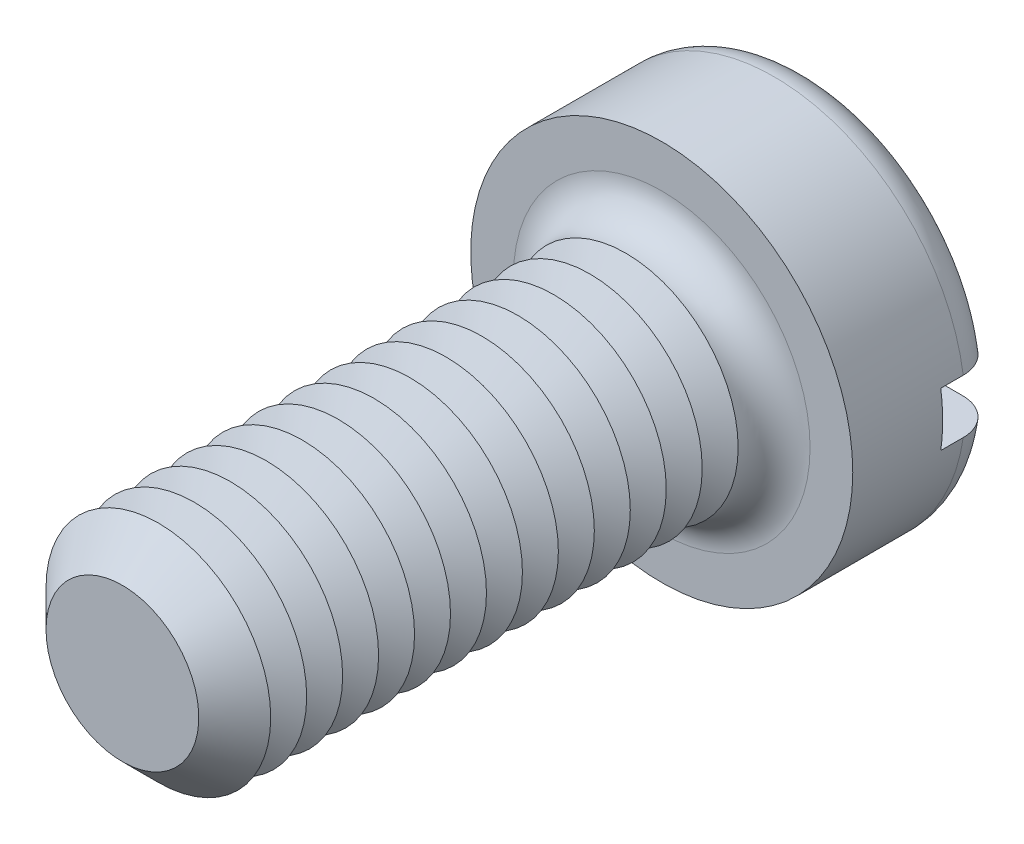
ISO-10303-21;
HEADER;
FILE_DESCRIPTION(('STEP AP214'),'2;1');
FILE_NAME('part.step','',(''),(''),'','','');
FILE_SCHEMA(('AUTOMOTIVE_DESIGN { 1 0 10303 214 1 1 1 1 }'));
ENDSEC;
DATA;
#1=APPLICATION_CONTEXT('core data for automotive mechanical design processes');
#2=APPLICATION_PROTOCOL_DEFINITION('international standard','automotive_design',2000,#1);
#3=PRODUCT_CONTEXT('',#1,'mechanical');
#4=PRODUCT('Part','Part','',(#3));
#5=PRODUCT_RELATED_PRODUCT_CATEGORY('part','',(#4));
#6=PRODUCT_DEFINITION_FORMATION('','',#4);
#7=PRODUCT_DEFINITION_CONTEXT('part definition',#1,'design');
#8=PRODUCT_DEFINITION('design','',#6,#7);
#9=PRODUCT_DEFINITION_SHAPE('','',#8);
#10=(LENGTH_UNIT() NAMED_UNIT(*) SI_UNIT(.MILLI.,.METRE.));
#11=(NAMED_UNIT(*) PLANE_ANGLE_UNIT() SI_UNIT($,.RADIAN.));
#12=(NAMED_UNIT(*) SI_UNIT($,.STERADIAN.) SOLID_ANGLE_UNIT());
#13=UNCERTAINTY_MEASURE_WITH_UNIT(LENGTH_MEASURE(1.E-05),#10,'distance_accuracy_value','');
#14=(GEOMETRIC_REPRESENTATION_CONTEXT(3) GLOBAL_UNCERTAINTY_ASSIGNED_CONTEXT((#13)) GLOBAL_UNIT_ASSIGNED_CONTEXT((#10,
#11,#12)) REPRESENTATION_CONTEXT('',''));
#15=CARTESIAN_POINT('',(0.,0.,0.));
#16=DIRECTION('',(0.,0.,1.));
#17=DIRECTION('',(1.,0.,0.));
#18=AXIS2_PLACEMENT_3D('',#15,#16,#17);
#19=CARTESIAN_POINT('',(0.,0.,-3.3));
#20=DIRECTION('',(0.,0.,1.));
#21=DIRECTION('',(1.,0.,0.));
#22=AXIS2_PLACEMENT_3D('',#19,#20,#21);
#23=PLANE('',#22);
#24=CARTESIAN_POINT('',(0.,0.,-3.3));
#25=DIRECTION('',(0.,0.,1.));
#26=DIRECTION('',(1.,0.,0.));
#27=AXIS2_PLACEMENT_3D('',#24,#25,#26);
#28=CIRCLE('',#27,3.45);
#29=CARTESIAN_POINT('',(-3.39742549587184,0.6,-3.3));
#30=VERTEX_POINT('',#29);
#31=CARTESIAN_POINT('',(3.39742549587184,0.6,-3.3));
#32=VERTEX_POINT('',#31);
#33=EDGE_CURVE('E116',#30,#32,#28,.F.);
#34=ORIENTED_EDGE('',*,*,#33,.T.);
#35=DIRECTION('',(1.,0.,0.));
#36=VECTOR('',#35,1.);
#37=CARTESIAN_POINT('',(-4.25,0.600000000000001,-3.3));
#38=LINE('',#37,#36);
#39=EDGE_CURVE('E111',#30,#32,#38,.T.);
#40=ORIENTED_EDGE('',*,*,#39,.F.);
#41=EDGE_LOOP('',(#34,#40));
#42=FACE_BOUND('',#41,.T.);
#43=ADVANCED_FACE('F39',(#42),#23,.F.);
#44=CARTESIAN_POINT('',(0.,0.,-2.5));
#45=DIRECTION('',(0.,0.,1.));
#46=DIRECTION('',(1.,0.,0.));
#47=AXIS2_PLACEMENT_3D('',#44,#45,#46);
#48=TOROIDAL_SURFACE('',#47,3.45,0.8);
#49=CARTESIAN_POINT('',(-4.06369072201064,0.600000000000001,-2.95537828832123));
#50=CARTESIAN_POINT('',(-4.03774340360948,0.600000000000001,-2.99245078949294));
#51=CARTESIAN_POINT('',(-4.00861849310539,0.600000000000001,-3.02734231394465));
#52=CARTESIAN_POINT('',(-3.94488199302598,0.600000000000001,-3.0917502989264));
#53=CARTESIAN_POINT('',(-3.91026320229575,0.600000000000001,-3.12125959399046));
#54=CARTESIAN_POINT('',(-3.83660561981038,0.600000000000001,-3.17403695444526));
#55=CARTESIAN_POINT('',(-3.79757117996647,0.6,-3.19731109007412));
#56=CARTESIAN_POINT('',(-3.71618817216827,0.6,-3.23703443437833));
#57=CARTESIAN_POINT('',(-3.67384041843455,0.6,-3.25348531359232));
#58=CARTESIAN_POINT('',(-3.58661930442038,0.6,-3.2792758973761));
#59=CARTESIAN_POINT('',(-3.54172669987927,0.6,-3.288550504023));
#60=CARTESIAN_POINT('',(-3.45102322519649,0.6,-3.29952632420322));
#61=CARTESIAN_POINT('',(-3.40521225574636,0.6,-3.30122671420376));
#62=CARTESIAN_POINT('',(-3.31340831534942,0.6,-3.29701196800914));
#63=CARTESIAN_POINT('',(-3.26741940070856,0.6,-3.29100823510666));
#64=CARTESIAN_POINT('',(-3.17708556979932,0.6,-3.27141469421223));
#65=CARTESIAN_POINT('',(-3.13274074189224,0.6,-3.25782447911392));
#66=CARTESIAN_POINT('',(-3.0466814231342,0.6,-3.22332549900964));
#67=CARTESIAN_POINT('',(-3.00498444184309,0.6,-3.20237301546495));
#68=CARTESIAN_POINT('',(-2.92572251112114,0.6,-3.15372961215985));
#69=CARTESIAN_POINT('',(-2.88815755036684,0.6,-3.12603871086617));
#70=CARTESIAN_POINT('',(-2.81847654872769,0.6,-3.06483322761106));
#71=CARTESIAN_POINT('',(-2.78633186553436,0.6,-3.03135128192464));
#72=CARTESIAN_POINT('',(-2.72824805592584,0.6,-2.95937651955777));
#73=CARTESIAN_POINT('',(-2.70230829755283,0.6,-2.92088421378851));
#74=CARTESIAN_POINT('',(-2.65791262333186,0.6,-2.84074227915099));
#75=CARTESIAN_POINT('',(-2.63932560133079,0.6,-2.79916531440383));
#76=CARTESIAN_POINT('',(-2.60958432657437,0.6,-2.7134333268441));
#77=CARTESIAN_POINT('',(-2.59842889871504,0.6,-2.66927871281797));
#78=CARTESIAN_POINT('',(-2.58411140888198,0.6,-2.58073966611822));
#79=CARTESIAN_POINT('',(-2.58077086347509,0.6,-2.5363840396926));
#80=CARTESIAN_POINT('',(-2.58167367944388,0.6,-2.44775208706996));
#81=CARTESIAN_POINT('',(-2.58591644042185,0.6,-2.40347575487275));
#82=CARTESIAN_POINT('',(-2.60175154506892,0.6,-2.31675105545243));
#83=CARTESIAN_POINT('',(-2.61326489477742,0.6,-2.27428821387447));
#84=CARTESIAN_POINT('',(-2.6431863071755,0.6,-2.19186794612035));
#85=CARTESIAN_POINT('',(-2.66159465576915,0.6,-2.15191062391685));
#86=CARTESIAN_POINT('',(-2.70494650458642,0.6,-2.07517696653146));
#87=CARTESIAN_POINT('',(-2.72995486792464,0.6,-2.03843731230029));
#88=CARTESIAN_POINT('',(-2.7856570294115,0.6,-1.96955746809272));
#89=CARTESIAN_POINT('',(-2.81635145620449,0.6,-1.93741778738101));
#90=CARTESIAN_POINT('',(-2.88329572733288,0.6,-1.87788048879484));
#91=CARTESIAN_POINT('',(-2.91965530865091,0.6,-1.85060625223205));
#92=CARTESIAN_POINT('',(-2.9963658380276,0.6,-1.80241044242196));
#93=CARTESIAN_POINT('',(-3.03671721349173,0.6,-1.78148955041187));
#94=CARTESIAN_POINT('',(-3.12111125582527,0.6,-1.74619829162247));
#95=CARTESIAN_POINT('',(-3.16521020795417,0.6,-1.73196239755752));
#96=CARTESIAN_POINT('',(-3.25516487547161,0.6,-1.71103773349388));
#97=CARTESIAN_POINT('',(-3.30102068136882,0.6,-1.70434935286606));
#98=CARTESIAN_POINT('',(-3.39352689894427,0.6,-1.69870104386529));
#99=CARTESIAN_POINT('',(-3.44018061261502,0.6,-1.69979487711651));
#100=CARTESIAN_POINT('',(-3.53263583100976,0.6,-1.70983959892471));
#101=CARTESIAN_POINT('',(-3.57843734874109,0.6,-1.71879036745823));
#102=CARTESIAN_POINT('',(-3.66763544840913,0.6,-1.74426972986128));
#103=CARTESIAN_POINT('',(-3.71104292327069,0.6,-1.76076015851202));
#104=CARTESIAN_POINT('',(-3.79442616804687,0.6,-1.80087686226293));
#105=CARTESIAN_POINT('',(-3.83440212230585,0.600000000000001,-1.82450275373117));
#106=CARTESIAN_POINT('',(-3.90929765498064,0.600000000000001,-1.87793548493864));
#107=CARTESIAN_POINT('',(-3.94426963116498,0.600000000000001,-1.90766887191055));
#108=CARTESIAN_POINT('',(-4.00864839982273,0.600000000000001,-1.9726503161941));
#109=CARTESIAN_POINT('',(-4.03805555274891,0.600000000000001,-2.00789801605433));
#110=CARTESIAN_POINT('',(-4.09009460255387,0.600000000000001,-2.08244463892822));
#111=CARTESIAN_POINT('',(-4.11280448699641,0.600000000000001,-2.12168912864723));
#112=CARTESIAN_POINT('',(-4.15124086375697,0.600000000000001,-2.2034588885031));
#113=CARTESIAN_POINT('',(-4.16696802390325,0.600000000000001,-2.24598384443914));
#114=CARTESIAN_POINT('',(-4.19085131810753,0.600000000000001,-2.33267862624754));
#115=CARTESIAN_POINT('',(-4.19907708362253,0.600000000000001,-2.37682928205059));
#116=CARTESIAN_POINT('',(-4.2079638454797,0.600000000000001,-2.46589754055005));
#117=CARTESIAN_POINT('',(-4.20862315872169,0.600000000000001,-2.51081531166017));
#118=CARTESIAN_POINT('',(-4.20236829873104,0.600000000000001,-2.59993343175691));
#119=CARTESIAN_POINT('',(-4.19548454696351,0.600000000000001,-2.64413593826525));
#120=CARTESIAN_POINT('',(-4.17439924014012,0.600000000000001,-2.73071930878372));
#121=CARTESIAN_POINT('',(-4.16020675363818,0.600000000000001,-2.77310235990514));
#122=CARTESIAN_POINT('',(-4.1318825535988,0.600000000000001,-2.83880495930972));
#123=CARTESIAN_POINT('',(-4.11991183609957,0.600000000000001,-2.86307959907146));
#124=CARTESIAN_POINT('',(-4.09356927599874,0.600000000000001,-2.91028856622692));
#125=CARTESIAN_POINT('',(-4.07919744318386,0.600000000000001,-2.9332228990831));
#126=CARTESIAN_POINT('',(-4.06369072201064,0.600000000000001,-2.95537828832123));
#127=B_SPLINE_CURVE_WITH_KNOTS('',3,(#49,#50,#51,#52,#53,#54,#55,#56,#57,#58,#59,#60,#61,#62,
#63,#64,#65,#66,#67,#68,#69,#70,#71,#72,#73,#74,#75,#76,#77,#78,#79,#80,#81,#82,#83,#84,#85,#86,
#87,#88,#89,#90,#91,#92,#93,#94,#95,#96,#97,#98,#99,#100,#101,#102,#103,#104,#105,#106,#107,
#108,#109,#110,#111,#112,#113,#114,#115,#116,#117,#118,#119,#120,#121,#122,#123,#124,#125,#126),
.UNSPECIFIED.,.T.,.F.,(4,2,2,2,2,2,2,2,2,2,2,2,2,2,2,2,2,2,2,2,2,2,2,2,2,2,2,2,2,2,2,2,2,2,2,2,
2,2,4),(0.,0.13565225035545,0.271483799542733,0.407182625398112,0.542848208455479,
0.679730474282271,0.816627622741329,0.955113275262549,1.09360635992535,1.23293614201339,
1.37226554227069,1.51083389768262,1.64938813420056,1.78534653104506,1.92128342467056,
2.0540840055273,2.18687407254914,2.31824564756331,2.44962267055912,2.58234229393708,
2.71507659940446,2.85080630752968,2.98655056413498,3.12491938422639,3.26329534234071,
3.40262816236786,3.54195885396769,3.68059194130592,3.81921757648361,3.95626453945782,
4.09330262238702,4.2286754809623,4.36403538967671,4.49812564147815,4.63224572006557,
4.76582687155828,4.89924267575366,4.98031194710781,5.0613808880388),.UNSPECIFIED.);
#128=CARTESIAN_POINT('',(-4.20743389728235,0.600000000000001,-2.50000000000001));
#129=VERTEX_POINT('',#128);
#130=EDGE_CURVE('E283',#129,#30,#127,.T.);
#131=ORIENTED_EDGE('',*,*,#130,.F.);
#132=CARTESIAN_POINT('',(0.,0.,-2.5));
#133=DIRECTION('',(0.,0.,1.));
#134=DIRECTION('',(1.,0.,0.));
#135=AXIS2_PLACEMENT_3D('',#132,#133,#134);
#136=CIRCLE('',#135,4.25);
#137=CARTESIAN_POINT('',(4.20743389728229,0.599999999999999,-2.5));
#138=VERTEX_POINT('',#137);
#139=EDGE_CURVE('E125',#138,#129,#136,.T.);
#140=ORIENTED_EDGE('',*,*,#139,.F.);
#141=CARTESIAN_POINT('',(2.63947327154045,0.6,-2.79608831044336));
#142=CARTESIAN_POINT('',(2.65655980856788,0.6,-2.83790320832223));
#143=CARTESIAN_POINT('',(2.67725642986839,0.6,-2.87828303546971));
#144=CARTESIAN_POINT('',(2.72519250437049,0.6,-2.95500233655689));
#145=CARTESIAN_POINT('',(2.75244152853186,0.6,-2.9913357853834));
#146=CARTESIAN_POINT('',(2.81257938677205,0.6,-3.05889430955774));
#147=CARTESIAN_POINT('',(2.84545995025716,0.6,-3.09012674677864));
#148=CARTESIAN_POINT('',(2.91591143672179,0.6,-3.14672620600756));
#149=CARTESIAN_POINT('',(2.95348119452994,0.6,-3.17209468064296));
#150=CARTESIAN_POINT('',(3.03291143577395,0.6,-3.21669611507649));
#151=CARTESIAN_POINT('',(3.07483186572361,0.6,-3.23582234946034));
#152=CARTESIAN_POINT('',(3.16126659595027,0.6,-3.26686062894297));
#153=CARTESIAN_POINT('',(3.2057811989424,0.6,-3.27877183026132));
#154=CARTESIAN_POINT('',(3.29669878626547,0.6,-3.29514603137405));
#155=CARTESIAN_POINT('',(3.34311773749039,0.6,-3.29952056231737));
#156=CARTESIAN_POINT('',(3.43603189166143,0.6,-3.30040472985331));
#157=CARTESIAN_POINT('',(3.48252709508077,0.6,-3.29691431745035));
#158=CARTESIAN_POINT('',(3.57420049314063,0.6,-3.28214240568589));
#159=CARTESIAN_POINT('',(3.61938038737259,0.6,-3.27087147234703));
#160=CARTESIAN_POINT('',(3.70717477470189,0.6,-3.24082890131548));
#161=CARTESIAN_POINT('',(3.74978938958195,0.6,-3.22205762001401));
#162=CARTESIAN_POINT('',(3.83078828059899,0.6,-3.17773607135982));
#163=CARTESIAN_POINT('',(3.86921015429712,0.599999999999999,-3.15225453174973));
#164=CARTESIAN_POINT('',(3.94116038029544,0.599999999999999,-3.09512672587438));
#165=CARTESIAN_POINT('',(3.9746890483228,0.599999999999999,-3.06348085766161));
#166=CARTESIAN_POINT('',(4.03545911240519,0.599999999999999,-2.99534640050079));
#167=CARTESIAN_POINT('',(4.06277344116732,0.599999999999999,-2.95892285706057));
#168=CARTESIAN_POINT('',(4.11082191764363,0.599999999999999,-2.88196698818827));
#169=CARTESIAN_POINT('',(4.13155647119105,0.599999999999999,-2.84143491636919));
#170=CARTESIAN_POINT('',(4.16563480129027,0.599999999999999,-2.75787550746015));
#171=CARTESIAN_POINT('',(4.1790544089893,0.599999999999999,-2.71487908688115));
#172=CARTESIAN_POINT('',(4.19843340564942,0.599999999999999,-2.62723691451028));
#173=CARTESIAN_POINT('',(4.20439310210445,0.599999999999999,-2.58259123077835));
#174=CARTESIAN_POINT('',(4.2086595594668,0.599999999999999,-2.49321831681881));
#175=CARTESIAN_POINT('',(4.20701422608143,0.599999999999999,-2.4484933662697));
#176=CARTESIAN_POINT('',(4.1962295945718,0.599999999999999,-2.35995704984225));
#177=CARTESIAN_POINT('',(4.18709040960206,0.599999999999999,-2.31614567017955));
#178=CARTESIAN_POINT('',(4.16160290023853,0.599999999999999,-2.23072100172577));
#179=CARTESIAN_POINT('',(4.14526169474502,0.599999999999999,-2.18910558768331));
#180=CARTESIAN_POINT('',(4.10585410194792,0.599999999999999,-2.10919238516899));
#181=CARTESIAN_POINT('',(4.08278762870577,0.599999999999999,-2.07089463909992));
#182=CARTESIAN_POINT('',(4.030487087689,0.599999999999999,-1.99851484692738));
#183=CARTESIAN_POINT('',(4.00122628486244,0.599999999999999,-1.9644521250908));
#184=CARTESIAN_POINT('',(3.93744772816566,0.599999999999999,-1.90166877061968));
#185=CARTESIAN_POINT('',(3.90292977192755,0.599999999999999,-1.87294834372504));
#186=CARTESIAN_POINT('',(3.82928727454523,0.599999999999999,-1.82137853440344));
#187=CARTESIAN_POINT('',(3.79012374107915,0.6,-1.79858484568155));
#188=CARTESIAN_POINT('',(3.70856025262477,0.6,-1.75980712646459));
#189=CARTESIAN_POINT('',(3.66616010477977,0.6,-1.74382350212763));
#190=CARTESIAN_POINT('',(3.57878495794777,0.6,-1.71891499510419));
#191=CARTESIAN_POINT('',(3.53378519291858,0.6,-1.71007699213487));
#192=CARTESIAN_POINT('',(3.44294322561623,0.6,-1.69998722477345));
#193=CARTESIAN_POINT('',(3.3971009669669,0.6,-1.69873596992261));
#194=CARTESIAN_POINT('',(3.30531297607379,0.6,-1.70385439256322));
#195=CARTESIAN_POINT('',(3.25937213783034,0.6,-1.71031204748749));
#196=CARTESIAN_POINT('',(3.1692099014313,0.6,-1.73080107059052));
#197=CARTESIAN_POINT('',(3.12498860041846,0.6,-1.74483286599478));
#198=CARTESIAN_POINT('',(3.03926209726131,0.6,-1.78018941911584));
#199=CARTESIAN_POINT('',(2.99777407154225,0.6,-1.80155586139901));
#200=CARTESIAN_POINT('',(2.91899881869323,0.6,-1.85098881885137));
#201=CARTESIAN_POINT('',(2.88171158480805,0.6,-1.8790553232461));
#202=CARTESIAN_POINT('',(2.81266124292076,0.6,-1.94094884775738));
#203=CARTESIAN_POINT('',(2.78086710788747,0.6,-1.97474122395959));
#204=CARTESIAN_POINT('',(2.72353615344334,0.6,-2.0472724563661));
#205=CARTESIAN_POINT('',(2.69799841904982,0.6,-2.08601058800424));
#206=CARTESIAN_POINT('',(2.65444718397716,0.6,-2.16655019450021));
#207=CARTESIAN_POINT('',(2.63629889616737,0.6,-2.20827875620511));
#208=CARTESIAN_POINT('',(2.60744942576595,0.6,-2.29424821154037));
#209=CARTESIAN_POINT('',(2.59674901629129,0.6,-2.33848936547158));
#210=CARTESIAN_POINT('',(2.5833312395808,0.6,-2.42714258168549));
#211=CARTESIAN_POINT('',(2.58043995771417,0.6,-2.47152848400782));
#212=CARTESIAN_POINT('',(2.58224493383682,0.6,-2.56010574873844));
#213=CARTESIAN_POINT('',(2.58693104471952,0.6,-2.60429729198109));
#214=CARTESIAN_POINT('',(2.60020046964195,0.6,-2.67311978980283));
#215=CARTESIAN_POINT('',(2.60635343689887,0.6,-2.69824441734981));
#216=CARTESIAN_POINT('',(2.62110140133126,0.6,-2.74776540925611));
#217=CARTESIAN_POINT('',(2.62969634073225,0.6,-2.77216179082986));
#218=CARTESIAN_POINT('',(2.63947327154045,0.6,-2.79608831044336));
#219=B_SPLINE_CURVE_WITH_KNOTS('',3,(#141,#142,#143,#144,#145,#146,#147,#148,#149,#150,#151,
#152,#153,#154,#155,#156,#157,#158,#159,#160,#161,#162,#163,#164,#165,#166,#167,#168,#169,#170,
#171,#172,#173,#174,#175,#176,#177,#178,#179,#180,#181,#182,#183,#184,#185,#186,#187,#188,#189,
#190,#191,#192,#193,#194,#195,#196,#197,#198,#199,#200,#201,#202,#203,#204,#205,#206,#207,#208,
#209,#210,#211,#212,#213,#214,#215,#216,#217,#218),.UNSPECIFIED.,.T.,.F.,(4,2,2,2,2,2,2,2,2,2,2,
2,2,2,2,2,2,2,2,2,2,2,2,2,2,2,2,2,2,2,2,2,2,2,2,2,2,2,4),(0.,0.135416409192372,
0.271031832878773,0.406449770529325,0.541834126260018,0.679424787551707,0.817031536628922,
0.956242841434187,1.09545501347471,1.23447850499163,1.37349539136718,1.51114036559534,
1.64877645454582,1.78470267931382,1.92062051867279,2.05510117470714,2.1895762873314,
2.32320547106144,2.45683263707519,2.59032801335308,2.72382509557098,2.85791055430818,
2.99200117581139,3.12730969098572,3.26262627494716,3.39956435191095,3.53651162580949,
3.67503685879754,3.81356990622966,3.95290367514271,4.09223721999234,4.23075602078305,
4.36925455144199,4.50509949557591,4.6409585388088,4.77376594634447,4.90639565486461,
4.98388287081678,5.06136825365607),.UNSPECIFIED.);
#220=EDGE_CURVE('E285',#32,#138,#219,.T.);
#221=ORIENTED_EDGE('',*,*,#220,.F.);
#222=ORIENTED_EDGE('',*,*,#33,.F.);
#223=EDGE_LOOP('',(#131,#140,#221,#222));
#224=FACE_BOUND('',#223,.T.);
#225=ADVANCED_FACE('F267',(#224),#48,.T.);
#226=CARTESIAN_POINT('',(0.,0.,-3.3));
#227=DIRECTION('',(0.,0.,1.));
#228=DIRECTION('',(1.,0.,0.));
#229=AXIS2_PLACEMENT_3D('',#226,#227,#228);
#230=CYLINDRICAL_SURFACE('',#229,4.25);
#231=DIRECTION('',(0.,0.,1.));
#232=VECTOR('',#231,1.);
#233=CARTESIAN_POINT('',(4.20743389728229,0.599999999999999,-3.3));
#234=LINE('',#233,#232);
#235=CARTESIAN_POINT('',(4.20743389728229,0.599999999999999,-2.));
#236=VERTEX_POINT('',#235);
#237=EDGE_CURVE('E301',#138,#236,#234,.T.);
#238=ORIENTED_EDGE('',*,*,#237,.F.);
#239=ORIENTED_EDGE('',*,*,#139,.T.);
#240=DIRECTION('',(0.,0.,1.));
#241=VECTOR('',#240,1.);
#242=CARTESIAN_POINT('',(-4.20743389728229,0.600000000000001,-3.3));
#243=LINE('',#242,#241);
#244=CARTESIAN_POINT('',(-4.20743389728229,0.600000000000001,-2.));
#245=VERTEX_POINT('',#244);
#246=EDGE_CURVE('E63',#245,#129,#243,.F.);
#247=ORIENTED_EDGE('',*,*,#246,.F.);
#248=CARTESIAN_POINT('',(0.,0.,-2.));
#249=DIRECTION('',(0.,0.,-1.));
#250=DIRECTION('',(-1.,0.,0.));
#251=AXIS2_PLACEMENT_3D('',#248,#249,#250);
#252=CIRCLE('',#251,4.25);
#253=CARTESIAN_POINT('',(-4.20743389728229,-0.599999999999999,-2.));
#254=VERTEX_POINT('',#253);
#255=EDGE_CURVE('E43',#245,#254,#252,.F.);
#256=ORIENTED_EDGE('',*,*,#255,.T.);
#257=DIRECTION('',(0.,0.,1.));
#258=VECTOR('',#257,1.);
#259=CARTESIAN_POINT('',(-4.20743389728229,-0.599999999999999,-3.3));
#260=LINE('',#259,#258);
#261=CARTESIAN_POINT('',(-4.20743389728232,-0.599999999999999,-2.5));
#262=VERTEX_POINT('',#261);
#263=EDGE_CURVE('E298',#262,#254,#260,.T.);
#264=ORIENTED_EDGE('',*,*,#263,.F.);
#265=CARTESIAN_POINT('',(4.20743389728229,-0.600000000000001,-2.5));
#266=VERTEX_POINT('',#265);
#267=EDGE_CURVE('E127',#262,#266,#136,.T.);
#268=ORIENTED_EDGE('',*,*,#267,.T.);
#269=DIRECTION('',(0.,0.,1.));
#270=VECTOR('',#269,1.);
#271=CARTESIAN_POINT('',(4.20743389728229,-0.600000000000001,-3.3));
#272=LINE('',#271,#270);
#273=CARTESIAN_POINT('',(4.20743389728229,-0.600000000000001,-2.));
#274=VERTEX_POINT('',#273);
#275=EDGE_CURVE('E55',#274,#266,#272,.F.);
#276=ORIENTED_EDGE('',*,*,#275,.F.);
#277=EDGE_CURVE('E11',#274,#236,#252,.F.);
#278=ORIENTED_EDGE('',*,*,#277,.T.);
#279=EDGE_LOOP('',(#238,#239,#247,#256,#264,#268,#276,#278));
#280=FACE_BOUND('',#279,.T.);
#281=CARTESIAN_POINT('',(0.,0.,0.));
#282=DIRECTION('',(0.,0.,1.));
#283=DIRECTION('',(1.,0.,0.));
#284=AXIS2_PLACEMENT_3D('',#281,#282,#283);
#285=CIRCLE('',#284,4.25);
#286=CARTESIAN_POINT('',(4.25,0.,0.));
#287=VERTEX_POINT('',#286);
#288=EDGE_CURVE('E304',#287,#287,#285,.T.);
#289=ORIENTED_EDGE('',*,*,#288,.F.);
#290=EDGE_LOOP('',(#289));
#291=FACE_BOUND('',#290,.T.);
#292=ADVANCED_FACE('F263',(#280,#291),#230,.T.);
#293=CARTESIAN_POINT('',(3.39742549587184,-0.6,-3.3));
#294=VERTEX_POINT('',#293);
#295=CARTESIAN_POINT('',(-3.39742549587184,-0.6,-3.3));
#296=VERTEX_POINT('',#295);
#297=EDGE_CURVE('E109',#294,#296,#28,.F.);
#298=ORIENTED_EDGE('',*,*,#297,.T.);
#299=DIRECTION('',(-1.,0.,0.));
#300=VECTOR('',#299,1.);
#301=CARTESIAN_POINT('',(-4.25,-0.599999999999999,-3.3));
#302=LINE('',#301,#300);
#303=EDGE_CURVE('E96',#294,#296,#302,.T.);
#304=ORIENTED_EDGE('',*,*,#303,.F.);
#305=EDGE_LOOP('',(#298,#304));
#306=FACE_BOUND('',#305,.T.);
#307=ADVANCED_FACE('F108',(#306),#23,.F.);
#308=CARTESIAN_POINT('',(0.,0.,0.));
#309=DIRECTION('',(0.,0.,1.));
#310=DIRECTION('',(1.,0.,0.));
#311=AXIS2_PLACEMENT_3D('',#308,#309,#310);
#312=PLANE('',#311);
#313=CARTESIAN_POINT('',(0.,0.,0.));
#314=DIRECTION('',(0.,0.,1.));
#315=DIRECTION('',(1.,0.,0.));
#316=AXIS2_PLACEMENT_3D('',#313,#314,#315);
#317=CIRCLE('',#316,3.3);
#318=CARTESIAN_POINT('',(3.3,0.,0.));
#319=VERTEX_POINT('',#318);
#320=EDGE_CURVE('E115',#319,#319,#317,.F.);
#321=ORIENTED_EDGE('',*,*,#320,.T.);
#322=EDGE_LOOP('',(#321));
#323=FACE_BOUND('',#322,.T.);
#324=ORIENTED_EDGE('',*,*,#288,.T.);
#325=EDGE_LOOP('',(#324));
#326=FACE_BOUND('',#325,.T.);
#327=ADVANCED_FACE('F262',(#323,#326),#312,.T.);
#328=CARTESIAN_POINT('',(-4.06369072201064,-0.599999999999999,-2.95537828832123));
#329=CARTESIAN_POINT('',(-4.08928577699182,-0.599999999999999,-2.91880204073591));
#330=CARTESIAN_POINT('',(-4.11182555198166,-0.599999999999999,-2.88005030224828));
#331=CARTESIAN_POINT('',(-4.15010404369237,-0.599999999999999,-2.79928452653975));
#332=CARTESIAN_POINT('',(-4.16583526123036,-0.599999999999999,-2.75726695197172));
#333=CARTESIAN_POINT('',(-4.19000286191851,-0.599999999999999,-2.67118996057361));
#334=CARTESIAN_POINT('',(-4.19844101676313,-0.599999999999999,-2.62713104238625));
#335=CARTESIAN_POINT('',(-4.20777174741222,-0.599999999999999,-2.53823222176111));
#336=CARTESIAN_POINT('',(-4.20866608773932,-0.599999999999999,-2.49339250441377));
#337=CARTESIAN_POINT('',(-4.20289683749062,-0.599999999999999,-2.40433856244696));
#338=CARTESIAN_POINT('',(-4.19625607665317,-0.599999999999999,-2.36012285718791));
#339=CARTESIAN_POINT('',(-4.17565084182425,-0.599999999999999,-2.27343166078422));
#340=CARTESIAN_POINT('',(-4.16168615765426,-0.599999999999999,-2.23095621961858));
#341=CARTESIAN_POINT('',(-4.12683188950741,-0.599999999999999,-2.14890863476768));
#342=CARTESIAN_POINT('',(-4.10593663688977,-0.599999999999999,-2.10933890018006));
#343=CARTESIAN_POINT('',(-4.05783763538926,-0.599999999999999,-2.03424145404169));
#344=CARTESIAN_POINT('',(-4.03063375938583,-0.599999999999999,-1.99871382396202));
#345=CARTESIAN_POINT('',(-3.97052236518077,-0.599999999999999,-1.93246905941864));
#346=CARTESIAN_POINT('',(-3.93758114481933,-0.599999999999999,-1.90178251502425));
#347=CARTESIAN_POINT('',(-3.86706007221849,-0.599999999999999,-1.84630837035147));
#348=CARTESIAN_POINT('',(-3.82948001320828,-0.6,-1.82152103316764));
#349=CARTESIAN_POINT('',(-3.75033766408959,-0.6,-1.77826995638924));
#350=CARTESIAN_POINT('',(-3.70873831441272,-0.6,-1.7598740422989));
#351=CARTESIAN_POINT('',(-3.62306661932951,-0.6,-1.73023196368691));
#352=CARTESIAN_POINT('',(-3.57899411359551,-0.6,-1.71898626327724));
#353=CARTESIAN_POINT('',(-3.48904845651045,-0.6,-1.70382025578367));
#354=CARTESIAN_POINT('',(-3.44315982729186,-0.6,-1.69999172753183));
#355=CARTESIAN_POINT('',(-3.35138360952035,-0.6,-1.7000083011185));
#356=CARTESIAN_POINT('',(-3.30549602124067,-0.6,-1.70385391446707));
#357=CARTESIAN_POINT('',(-3.21452492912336,-0.6,-1.71917227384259));
#358=CARTESIAN_POINT('',(-3.16945455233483,-0.6,-1.73072307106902));
#359=CARTESIAN_POINT('',(-3.08188104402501,-0.6,-1.76120640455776));
#360=CARTESIAN_POINT('',(-3.0393780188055,-0.6,-1.78013924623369));
#361=CARTESIAN_POINT('',(-2.95805296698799,-0.6,-1.82493384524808));
#362=CARTESIAN_POINT('',(-2.9192403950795,-0.6,-1.85081278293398));
#363=CARTESIAN_POINT('',(-2.84656695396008,-0.6,-1.90878317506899));
#364=CARTESIAN_POINT('',(-2.81270591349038,-0.6,-1.94087441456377));
#365=CARTESIAN_POINT('',(-2.75131050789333,-0.6,-2.01002500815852));
#366=CARTESIAN_POINT('',(-2.72371339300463,-0.6,-2.04702860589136));
#367=CARTESIAN_POINT('',(-2.67528742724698,-0.6,-2.12522869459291));
#368=CARTESIAN_POINT('',(-2.65445765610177,-0.6,-2.1664246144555));
#369=CARTESIAN_POINT('',(-2.62065354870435,-0.6,-2.25087266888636));
#370=CARTESIAN_POINT('',(-2.60751663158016,-0.6,-2.29405971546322));
#371=CARTESIAN_POINT('',(-2.58885106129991,-0.6,-2.38204659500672));
#372=CARTESIAN_POINT('',(-2.58332131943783,-0.6,-2.42684619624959));
#373=CARTESIAN_POINT('',(-2.58009777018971,-0.6,-2.51580379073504));
#374=CARTESIAN_POINT('',(-2.58224575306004,-0.6,-2.55995612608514));
#375=CARTESIAN_POINT('',(-2.59395205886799,-0.6,-2.64726495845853));
#376=CARTESIAN_POINT('',(-2.60351013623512,-0.6,-2.69042148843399));
#377=CARTESIAN_POINT('',(-2.62967159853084,-0.6,-2.77438771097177));
#378=CARTESIAN_POINT('',(-2.64625243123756,-0.6,-2.81520444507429));
#379=CARTESIAN_POINT('',(-2.68592348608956,-0.6,-2.89353901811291));
#380=CARTESIAN_POINT('',(-2.70901418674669,-0.6,-2.9310566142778));
#381=CARTESIAN_POINT('',(-2.7614318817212,-0.6,-3.00240040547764));
#382=CARTESIAN_POINT('',(-2.79085487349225,-0.6,-3.03615603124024));
#383=CARTESIAN_POINT('',(-2.85483456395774,-0.6,-3.09838834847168));
#384=CARTESIAN_POINT('',(-2.88939187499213,-0.6,-3.12686440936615));
#385=CARTESIAN_POINT('',(-2.96351967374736,-0.6,-3.17841283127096));
#386=CARTESIAN_POINT('',(-3.00318741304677,-0.6,-3.20134539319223));
#387=CARTESIAN_POINT('',(-3.08576649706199,-0.6,-3.24034364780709));
#388=CARTESIAN_POINT('',(-3.12867814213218,-0.6,-3.25640870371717));
#389=CARTESIAN_POINT('',(-3.21724048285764,-0.6,-3.28143816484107));
#390=CARTESIAN_POINT('',(-3.26292314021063,-0.6,-3.29028963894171));
#391=CARTESIAN_POINT('',(-3.35512527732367,-0.6,-3.30021681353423));
#392=CARTESIAN_POINT('',(-3.40164474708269,-0.6,-3.30129260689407));
#393=CARTESIAN_POINT('',(-3.49429978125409,-0.6,-3.29560589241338));
#394=CARTESIAN_POINT('',(-3.54043436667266,-0.6,-3.28882735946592));
#395=CARTESIAN_POINT('',(-3.63090382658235,-0.6,-3.26755492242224));
#396=CARTESIAN_POINT('',(-3.67523831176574,-0.6,-3.25305935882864));
#397=CARTESIAN_POINT('',(-3.76046509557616,-0.6,-3.21686867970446));
#398=CARTESIAN_POINT('',(-3.80138087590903,-0.599999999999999,-3.1952288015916));
#399=CARTESIAN_POINT('',(-3.8788986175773,-0.599999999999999,-3.14531817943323));
#400=CARTESIAN_POINT('',(-3.91550599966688,-0.599999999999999,-3.11705590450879));
#401=CARTESIAN_POINT('',(-3.97074313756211,-0.599999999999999,-3.06628809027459));
#402=CARTESIAN_POINT('',(-3.99100743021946,-0.599999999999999,-3.04553102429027));
#403=CARTESIAN_POINT('',(-4.02917385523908,-0.599999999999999,-3.00194762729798));
#404=CARTESIAN_POINT('',(-4.04707600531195,-0.599999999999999,-2.97912131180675));
#405=CARTESIAN_POINT('',(-4.06369072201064,-0.599999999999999,-2.95537828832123));
#406=B_SPLINE_CURVE_WITH_KNOTS('',3,(#328,#329,#330,#331,#332,#333,#334,#335,#336,#337,#338,
#339,#340,#341,#342,#343,#344,#345,#346,#347,#348,#349,#350,#351,#352,#353,#354,#355,#356,#357,
#358,#359,#360,#361,#362,#363,#364,#365,#366,#367,#368,#369,#370,#371,#372,#373,#374,#375,#376,
#377,#378,#379,#380,#381,#382,#383,#384,#385,#386,#387,#388,#389,#390,#391,#392,#393,#394,#395,
#396,#397,#398,#399,#400,#401,#402,#403,#404,#405),.UNSPECIFIED.,.T.,.F.,(4,2,2,2,2,2,2,2,2,2,2,
2,2,2,2,2,2,2,2,2,2,2,2,2,2,2,2,2,2,2,2,2,2,2,2,2,2,2,4),(0.,0.133821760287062,
0.267790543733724,0.401726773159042,0.535631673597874,0.669131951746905,0.802636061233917,
0.936249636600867,1.06986590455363,1.2042952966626,1.3387306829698,1.47455198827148,
1.61038210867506,1.74788249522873,1.88539204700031,2.02431612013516,2.16324594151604,
2.30252260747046,2.4417944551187,2.57960263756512,2.71739207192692,2.85215325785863,
2.98689515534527,3.11887666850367,3.25085380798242,3.38241030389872,3.51397647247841,
3.64769871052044,3.78143690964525,3.91826005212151,4.05509587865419,4.19403485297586,
4.33297216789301,4.47219345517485,4.61144469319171,4.74964356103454,4.887666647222,
4.97453605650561,5.06140481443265),.UNSPECIFIED.);
#407=EDGE_CURVE('E103',#296,#262,#406,.T.);
#408=ORIENTED_EDGE('',*,*,#407,.F.);
#409=ORIENTED_EDGE('',*,*,#297,.F.);
#410=CARTESIAN_POINT('',(2.63947327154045,-0.6,-2.79608831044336));
#411=CARTESIAN_POINT('',(2.62285766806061,-0.6,-2.75541510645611));
#412=CARTESIAN_POINT('',(2.60963282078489,-0.6,-2.71332585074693));
#413=CARTESIAN_POINT('',(2.59042394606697,-0.6,-2.62749460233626));
#414=CARTESIAN_POINT('',(2.58444686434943,-0.6,-2.58375106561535));
#415=CARTESIAN_POINT('',(2.57995287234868,-0.6,-2.49588524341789));
#416=CARTESIAN_POINT('',(2.58143477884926,-0.6,-2.45176301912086));
#417=CARTESIAN_POINT('',(2.59180622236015,-0.6,-2.36440906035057));
#418=CARTESIAN_POINT('',(2.60069434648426,-0.6,-2.32117715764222));
#419=CARTESIAN_POINT('',(2.62554964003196,-0.6,-2.23689909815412));
#420=CARTESIAN_POINT('',(2.6415022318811,-0.6,-2.19584863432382));
#421=CARTESIAN_POINT('',(2.67996913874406,-0.6,-2.11694797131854));
#422=CARTESIAN_POINT('',(2.70248409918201,-0.6,-2.07909808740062));
#423=CARTESIAN_POINT('',(2.75378972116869,-0.6,-2.00702296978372));
#424=CARTESIAN_POINT('',(2.7826732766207,-0.6,-1.97286389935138));
#425=CARTESIAN_POINT('',(2.84564717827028,-0.6,-1.90974167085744));
#426=CARTESIAN_POINT('',(2.87973812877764,-0.6,-1.88077911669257));
#427=CARTESIAN_POINT('',(2.95300941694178,-0.6,-1.82817307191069));
#428=CARTESIAN_POINT('',(2.99228920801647,-0.6,-1.8046680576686));
#429=CARTESIAN_POINT('',(3.07419050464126,-0.6,-1.76446470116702));
#430=CARTESIAN_POINT('',(3.11681231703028,-0.6,-1.74776698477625));
#431=CARTESIAN_POINT('',(3.20492149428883,-0.6,-1.72140945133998));
#432=CARTESIAN_POINT('',(3.25044365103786,-0.6,-1.71186578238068));
#433=CARTESIAN_POINT('',(3.34244451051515,-0.6,-1.70053183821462));
#434=CARTESIAN_POINT('',(3.38892324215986,-0.6,-1.69874179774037));
#435=CARTESIAN_POINT('',(3.48165030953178,-0.6,-1.70299737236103));
#436=CARTESIAN_POINT('',(3.52789766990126,-0.6,-1.70906439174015));
#437=CARTESIAN_POINT('',(3.61869999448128,-0.6,-1.72893768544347));
#438=CARTESIAN_POINT('',(3.6632550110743,-0.6,-1.742743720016));
#439=CARTESIAN_POINT('',(3.7490339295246,-0.6,-1.77760539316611));
#440=CARTESIAN_POINT('',(3.79028083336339,-0.600000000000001,-1.79860440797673));
#441=CARTESIAN_POINT('',(3.86860401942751,-0.600000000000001,-1.84731105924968));
#442=CARTESIAN_POINT('',(3.90568056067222,-0.600000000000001,-1.87501827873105));
#443=CARTESIAN_POINT('',(3.97412845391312,-0.600000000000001,-1.93599408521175));
#444=CARTESIAN_POINT('',(4.00556369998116,-0.600000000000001,-1.96919094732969));
#445=CARTESIAN_POINT('',(4.06233546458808,-0.600000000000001,-2.0404445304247));
#446=CARTESIAN_POINT('',(4.08767237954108,-0.600000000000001,-2.07850093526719));
#447=CARTESIAN_POINT('',(4.13122502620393,-0.600000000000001,-2.15791791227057));
#448=CARTESIAN_POINT('',(4.14951966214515,-0.600000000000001,-2.19923522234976));
#449=CARTESIAN_POINT('',(4.17884974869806,-0.600000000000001,-2.28437065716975));
#450=CARTESIAN_POINT('',(4.18988555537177,-0.600000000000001,-2.32818865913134));
#451=CARTESIAN_POINT('',(4.20430724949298,-0.600000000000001,-2.41670951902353));
#452=CARTESIAN_POINT('',(4.2077528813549,-0.600000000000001,-2.46140265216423));
#453=CARTESIAN_POINT('',(4.20706844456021,-0.600000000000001,-2.55073028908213));
#454=CARTESIAN_POINT('',(4.20293856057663,-0.600000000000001,-2.595364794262));
#455=CARTESIAN_POINT('',(4.18724926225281,-0.600000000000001,-2.68317733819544));
#456=CARTESIAN_POINT('',(4.17571081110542,-0.600000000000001,-2.72635912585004));
#457=CARTESIAN_POINT('',(4.14556645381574,-0.600000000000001,-2.81017999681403));
#458=CARTESIAN_POINT('',(4.12696052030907,-0.600000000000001,-2.85081907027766));
#459=CARTESIAN_POINT('',(4.08317014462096,-0.600000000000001,-2.92852328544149));
#460=CARTESIAN_POINT('',(4.0579684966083,-0.600000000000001,-2.96557872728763));
#461=CARTESIAN_POINT('',(4.00174565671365,-0.600000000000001,-3.034972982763));
#462=CARTESIAN_POINT('',(3.97072429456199,-0.600000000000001,-3.06731165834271));
#463=CARTESIAN_POINT('',(3.90349659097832,-0.600000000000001,-3.12662735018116));
#464=CARTESIAN_POINT('',(3.86725240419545,-0.600000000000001,-3.15356146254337));
#465=CARTESIAN_POINT('',(3.79079809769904,-0.600000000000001,-3.20104156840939));
#466=CARTESIAN_POINT('',(3.75058775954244,-0.6,-3.22158720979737));
#467=CARTESIAN_POINT('',(3.6668595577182,-0.6,-3.25595832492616));
#468=CARTESIAN_POINT('',(3.62330947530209,-0.6,-3.26970530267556));
#469=CARTESIAN_POINT('',(3.53453348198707,-0.6,-3.28979004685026));
#470=CARTESIAN_POINT('',(3.48930745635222,-0.6,-3.29612730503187));
#471=CARTESIAN_POINT('',(3.39787506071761,-0.6,-3.30128612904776));
#472=CARTESIAN_POINT('',(3.35166346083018,-0.6,-3.30001513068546));
#473=CARTESIAN_POINT('',(3.26009663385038,-0.6,-3.28980210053));
#474=CARTESIAN_POINT('',(3.21474142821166,-0.6,-3.28085987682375));
#475=CARTESIAN_POINT('',(3.12577990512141,-0.6,-3.2554540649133));
#476=CARTESIAN_POINT('',(3.08219120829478,-0.6,-3.23892872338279));
#477=CARTESIAN_POINT('',(2.99839730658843,-0.6,-3.1987810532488));
#478=CARTESIAN_POINT('',(2.95819301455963,-0.6,-3.17515681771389));
#479=CARTESIAN_POINT('',(2.88239372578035,-0.6,-3.12147666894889));
#480=CARTESIAN_POINT('',(2.84679445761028,-0.6,-3.09142678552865));
#481=CARTESIAN_POINT('',(2.78127483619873,-0.6,-3.02571584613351));
#482=CARTESIAN_POINT('',(2.75134725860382,-0.6,-2.99006203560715));
#483=CARTESIAN_POINT('',(2.70767232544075,-0.6,-2.92780516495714));
#484=CARTESIAN_POINT('',(2.69197340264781,-0.6,-2.90254809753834));
#485=CARTESIAN_POINT('',(2.66349078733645,-0.6,-2.8504392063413));
#486=CARTESIAN_POINT('',(2.65070705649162,-0.6,-2.82358740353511));
#487=CARTESIAN_POINT('',(2.63947327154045,-0.6,-2.79608831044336));
#488=B_SPLINE_CURVE_WITH_KNOTS('',3,(#410,#411,#412,#413,#414,#415,#416,#417,#418,#419,#420,
#421,#422,#423,#424,#425,#426,#427,#428,#429,#430,#431,#432,#433,#434,#435,#436,#437,#438,#439,
#440,#441,#442,#443,#444,#445,#446,#447,#448,#449,#450,#451,#452,#453,#454,#455,#456,#457,#458,
#459,#460,#461,#462,#463,#464,#465,#466,#467,#468,#469,#470,#471,#472,#473,#474,#475,#476,#477,
#478,#479,#480,#481,#482,#483,#484,#485,#486,#487),.UNSPECIFIED.,.T.,.F.,(4,2,2,2,2,2,2,2,2,2,2,
2,2,2,2,2,2,2,2,2,2,2,2,2,2,2,2,2,2,2,2,2,2,2,2,2,2,2,4),(0.,0.131701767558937,
0.263529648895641,0.395336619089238,0.527118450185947,0.658629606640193,0.790153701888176,
0.923740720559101,1.05734325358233,1.19403504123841,1.33073939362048,1.46961778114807,
1.60850037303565,1.74776210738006,1.88701952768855,2.02520497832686,2.16338184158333,
2.29987843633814,2.43636615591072,2.57127672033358,2.7061806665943,2.84001889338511,
2.97385385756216,3.1073117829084,3.24077022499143,3.37458034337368,3.50839437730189,
3.64323196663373,3.77807698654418,3.91444452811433,4.05082142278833,4.18886086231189,
4.32690375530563,4.46609131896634,4.60531630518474,4.74441121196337,4.88332773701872,
4.97237227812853,5.06141564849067),.UNSPECIFIED.);
#489=EDGE_CURVE('E92',#266,#294,#488,.T.);
#490=ORIENTED_EDGE('',*,*,#489,.F.);
#491=ORIENTED_EDGE('',*,*,#267,.F.);
#492=EDGE_LOOP('',(#408,#409,#490,#491));
#493=FACE_BOUND('',#492,.T.);
#494=ADVANCED_FACE('F113',(#493),#48,.T.);
#495=CARTESIAN_POINT('',(0.,0.,0.8));
#496=DIRECTION('',(0.,0.,1.));
#497=DIRECTION('',(1.,0.,0.));
#498=AXIS2_PLACEMENT_3D('',#495,#496,#497);
#499=TOROIDAL_SURFACE('',#498,3.3,0.8);
#500=ORIENTED_EDGE('',*,*,#320,.F.);
#501=EDGE_LOOP('',(#500));
#502=FACE_BOUND('',#501,.T.);
#503=CARTESIAN_POINT('',(0.,0.,0.8));
#504=DIRECTION('',(0.,0.,-1.));
#505=DIRECTION('',(-1.,0.,0.));
#506=AXIS2_PLACEMENT_3D('',#503,#504,#505);
#507=CIRCLE('',#506,2.5);
#508=CARTESIAN_POINT('',(-2.5,0.,0.8));
#509=VERTEX_POINT('',#508);
#510=EDGE_CURVE('E309',#509,#509,#507,.T.);
#511=ORIENTED_EDGE('',*,*,#510,.T.);
#512=EDGE_LOOP('',(#511));
#513=FACE_BOUND('',#512,.T.);
#514=ADVANCED_FACE('F255',(#502,#513),#499,.F.);
#515=CARTESIAN_POINT('',(0.,0.,1.2));
#516=DIRECTION('',(0.,0.,-1.));
#517=DIRECTION('',(-1.,0.,0.));
#518=AXIS2_PLACEMENT_3D('',#515,#516,#517);
#519=CONICAL_SURFACE('',#518,1.80717967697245,1.0471975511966);
#520=ORIENTED_EDGE('',*,*,#510,.F.);
#521=EDGE_LOOP('',(#520));
#522=FACE_BOUND('',#521,.T.);
#523=CARTESIAN_POINT('',(0.,0.,1.2));
#524=DIRECTION('',(0.,0.,-1.));
#525=DIRECTION('',(-1.,0.,0.));
#526=AXIS2_PLACEMENT_3D('',#523,#524,#525);
#527=CIRCLE('',#526,1.80717967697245);
#528=CARTESIAN_POINT('',(-1.80717967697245,0.,1.2));
#529=VERTEX_POINT('',#528);
#530=EDGE_CURVE('E316',#529,#529,#527,.T.);
#531=ORIENTED_EDGE('',*,*,#530,.T.);
#532=EDGE_LOOP('',(#531));
#533=FACE_BOUND('',#532,.T.);
#534=ADVANCED_FACE('F251',(#522,#533),#519,.T.);
#535=CARTESIAN_POINT('',(0.,0.,1.6));
#536=DIRECTION('',(0.,0.,1.));
#537=DIRECTION('',(1.,0.,0.));
#538=AXIS2_PLACEMENT_3D('',#535,#536,#537);
#539=CONICAL_SURFACE('',#538,2.5,1.0471975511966);
#540=ORIENTED_EDGE('',*,*,#530,.F.);
#541=EDGE_LOOP('',(#540));
#542=FACE_BOUND('',#541,.T.);
#543=CARTESIAN_POINT('',(0.,0.,1.6));
#544=DIRECTION('',(0.,0.,-1.));
#545=DIRECTION('',(-1.,0.,0.));
#546=AXIS2_PLACEMENT_3D('',#543,#544,#545);
#547=CIRCLE('',#546,2.5);
#548=CARTESIAN_POINT('',(-2.5,0.,1.6));
#549=VERTEX_POINT('',#548);
#550=EDGE_CURVE('E321',#549,#549,#547,.T.);
#551=ORIENTED_EDGE('',*,*,#550,.T.);
#552=EDGE_LOOP('',(#551));
#553=FACE_BOUND('',#552,.T.);
#554=ADVANCED_FACE('F247',(#542,#553),#539,.T.);
#555=CARTESIAN_POINT('',(0.,0.,2.));
#556=DIRECTION('',(0.,0.,-1.));
#557=DIRECTION('',(-1.,0.,0.));
#558=AXIS2_PLACEMENT_3D('',#555,#556,#557);
#559=CONICAL_SURFACE('',#558,1.80717967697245,1.0471975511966);
#560=ORIENTED_EDGE('',*,*,#550,.F.);
#561=EDGE_LOOP('',(#560));
#562=FACE_BOUND('',#561,.T.);
#563=CARTESIAN_POINT('',(0.,0.,2.));
#564=DIRECTION('',(0.,0.,-1.));
#565=DIRECTION('',(-1.,0.,0.));
#566=AXIS2_PLACEMENT_3D('',#563,#564,#565);
#567=CIRCLE('',#566,1.80717967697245);
#568=CARTESIAN_POINT('',(-1.80717967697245,0.,2.));
#569=VERTEX_POINT('',#568);
#570=EDGE_CURVE('E325',#569,#569,#567,.T.);
#571=ORIENTED_EDGE('',*,*,#570,.T.);
#572=EDGE_LOOP('',(#571));
#573=FACE_BOUND('',#572,.T.);
#574=ADVANCED_FACE('F243',(#562,#573),#559,.T.);
#575=CARTESIAN_POINT('',(0.,0.,2.4));
#576=DIRECTION('',(0.,0.,1.));
#577=DIRECTION('',(1.,0.,0.));
#578=AXIS2_PLACEMENT_3D('',#575,#576,#577);
#579=CONICAL_SURFACE('',#578,2.5,1.0471975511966);
#580=ORIENTED_EDGE('',*,*,#570,.F.);
#581=EDGE_LOOP('',(#580));
#582=FACE_BOUND('',#581,.T.);
#583=CARTESIAN_POINT('',(0.,0.,2.4));
#584=DIRECTION('',(0.,0.,-1.));
#585=DIRECTION('',(-1.,0.,0.));
#586=AXIS2_PLACEMENT_3D('',#583,#584,#585);
#587=CIRCLE('',#586,2.5);
#588=CARTESIAN_POINT('',(-2.5,0.,2.4));
#589=VERTEX_POINT('',#588);
#590=EDGE_CURVE('E329',#589,#589,#587,.T.);
#591=ORIENTED_EDGE('',*,*,#590,.T.);
#592=EDGE_LOOP('',(#591));
#593=FACE_BOUND('',#592,.T.);
#594=ADVANCED_FACE('F239',(#582,#593),#579,.T.);
#595=CARTESIAN_POINT('',(0.,0.,2.8));
#596=DIRECTION('',(0.,0.,-1.));
#597=DIRECTION('',(-1.,0.,0.));
#598=AXIS2_PLACEMENT_3D('',#595,#596,#597);
#599=CONICAL_SURFACE('',#598,1.80717967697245,1.0471975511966);
#600=ORIENTED_EDGE('',*,*,#590,.F.);
#601=EDGE_LOOP('',(#600));
#602=FACE_BOUND('',#601,.T.);
#603=CARTESIAN_POINT('',(0.,0.,2.8));
#604=DIRECTION('',(0.,0.,-1.));
#605=DIRECTION('',(-1.,0.,0.));
#606=AXIS2_PLACEMENT_3D('',#603,#604,#605);
#607=CIRCLE('',#606,1.80717967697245);
#608=CARTESIAN_POINT('',(-1.80717967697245,0.,2.8));
#609=VERTEX_POINT('',#608);
#610=EDGE_CURVE('E332',#609,#609,#607,.T.);
#611=ORIENTED_EDGE('',*,*,#610,.T.);
#612=EDGE_LOOP('',(#611));
#613=FACE_BOUND('',#612,.T.);
#614=ADVANCED_FACE('F235',(#602,#613),#599,.T.);
#615=CARTESIAN_POINT('',(0.,0.,3.2));
#616=DIRECTION('',(0.,0.,1.));
#617=DIRECTION('',(1.,0.,0.));
#618=AXIS2_PLACEMENT_3D('',#615,#616,#617);
#619=CONICAL_SURFACE('',#618,2.5,1.0471975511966);
#620=ORIENTED_EDGE('',*,*,#610,.F.);
#621=EDGE_LOOP('',(#620));
#622=FACE_BOUND('',#621,.T.);
#623=CARTESIAN_POINT('',(0.,0.,3.2));
#624=DIRECTION('',(0.,0.,-1.));
#625=DIRECTION('',(-1.,0.,0.));
#626=AXIS2_PLACEMENT_3D('',#623,#624,#625);
#627=CIRCLE('',#626,2.5);
#628=CARTESIAN_POINT('',(-2.5,0.,3.2));
#629=VERTEX_POINT('',#628);
#630=EDGE_CURVE('E335',#629,#629,#627,.T.);
#631=ORIENTED_EDGE('',*,*,#630,.T.);
#632=EDGE_LOOP('',(#631));
#633=FACE_BOUND('',#632,.T.);
#634=ADVANCED_FACE('F231',(#622,#633),#619,.T.);
#635=CARTESIAN_POINT('',(0.,0.,3.6));
#636=DIRECTION('',(0.,0.,-1.));
#637=DIRECTION('',(-1.,0.,0.));
#638=AXIS2_PLACEMENT_3D('',#635,#636,#637);
#639=CONICAL_SURFACE('',#638,1.80717967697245,1.0471975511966);
#640=ORIENTED_EDGE('',*,*,#630,.F.);
#641=EDGE_LOOP('',(#640));
#642=FACE_BOUND('',#641,.T.);
#643=CARTESIAN_POINT('',(0.,0.,3.6));
#644=DIRECTION('',(0.,0.,-1.));
#645=DIRECTION('',(-1.,0.,0.));
#646=AXIS2_PLACEMENT_3D('',#643,#644,#645);
#647=CIRCLE('',#646,1.80717967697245);
#648=CARTESIAN_POINT('',(-1.80717967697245,0.,3.6));
#649=VERTEX_POINT('',#648);
#650=EDGE_CURVE('E339',#649,#649,#647,.T.);
#651=ORIENTED_EDGE('',*,*,#650,.T.);
#652=EDGE_LOOP('',(#651));
#653=FACE_BOUND('',#652,.T.);
#654=ADVANCED_FACE('F227',(#642,#653),#639,.T.);
#655=CARTESIAN_POINT('',(0.,0.,4.));
#656=DIRECTION('',(0.,0.,1.));
#657=DIRECTION('',(1.,0.,0.));
#658=AXIS2_PLACEMENT_3D('',#655,#656,#657);
#659=CONICAL_SURFACE('',#658,2.5,1.0471975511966);
#660=ORIENTED_EDGE('',*,*,#650,.F.);
#661=EDGE_LOOP('',(#660));
#662=FACE_BOUND('',#661,.T.);
#663=CARTESIAN_POINT('',(0.,0.,4.));
#664=DIRECTION('',(0.,0.,-1.));
#665=DIRECTION('',(-1.,0.,0.));
#666=AXIS2_PLACEMENT_3D('',#663,#664,#665);
#667=CIRCLE('',#666,2.5);
#668=CARTESIAN_POINT('',(-2.5,0.,4.));
#669=VERTEX_POINT('',#668);
#670=EDGE_CURVE('E343',#669,#669,#667,.T.);
#671=ORIENTED_EDGE('',*,*,#670,.T.);
#672=EDGE_LOOP('',(#671));
#673=FACE_BOUND('',#672,.T.);
#674=ADVANCED_FACE('F223',(#662,#673),#659,.T.);
#675=CARTESIAN_POINT('',(0.,0.,4.4));
#676=DIRECTION('',(0.,0.,-1.));
#677=DIRECTION('',(-1.,0.,0.));
#678=AXIS2_PLACEMENT_3D('',#675,#676,#677);
#679=CONICAL_SURFACE('',#678,1.80717967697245,1.0471975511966);
#680=ORIENTED_EDGE('',*,*,#670,.F.);
#681=EDGE_LOOP('',(#680));
#682=FACE_BOUND('',#681,.T.);
#683=CARTESIAN_POINT('',(0.,0.,4.4));
#684=DIRECTION('',(0.,0.,-1.));
#685=DIRECTION('',(-1.,0.,0.));
#686=AXIS2_PLACEMENT_3D('',#683,#684,#685);
#687=CIRCLE('',#686,1.80717967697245);
#688=CARTESIAN_POINT('',(-1.80717967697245,0.,4.4));
#689=VERTEX_POINT('',#688);
#690=EDGE_CURVE('E346',#689,#689,#687,.T.);
#691=ORIENTED_EDGE('',*,*,#690,.T.);
#692=EDGE_LOOP('',(#691));
#693=FACE_BOUND('',#692,.T.);
#694=ADVANCED_FACE('F219',(#682,#693),#679,.T.);
#695=CARTESIAN_POINT('',(0.,0.,4.8));
#696=DIRECTION('',(0.,0.,1.));
#697=DIRECTION('',(1.,0.,0.));
#698=AXIS2_PLACEMENT_3D('',#695,#696,#697);
#699=CONICAL_SURFACE('',#698,2.5,1.0471975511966);
#700=ORIENTED_EDGE('',*,*,#690,.F.);
#701=EDGE_LOOP('',(#700));
#702=FACE_BOUND('',#701,.T.);
#703=CARTESIAN_POINT('',(0.,0.,4.8));
#704=DIRECTION('',(0.,0.,-1.));
#705=DIRECTION('',(-1.,0.,0.));
#706=AXIS2_PLACEMENT_3D('',#703,#704,#705);
#707=CIRCLE('',#706,2.5);
#708=CARTESIAN_POINT('',(-2.5,0.,4.8));
#709=VERTEX_POINT('',#708);
#710=EDGE_CURVE('E350',#709,#709,#707,.T.);
#711=ORIENTED_EDGE('',*,*,#710,.T.);
#712=EDGE_LOOP('',(#711));
#713=FACE_BOUND('',#712,.T.);
#714=ADVANCED_FACE('F215',(#702,#713),#699,.T.);
#715=CARTESIAN_POINT('',(0.,0.,5.2));
#716=DIRECTION('',(0.,0.,-1.));
#717=DIRECTION('',(-1.,0.,0.));
#718=AXIS2_PLACEMENT_3D('',#715,#716,#717);
#719=CONICAL_SURFACE('',#718,1.80717967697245,1.0471975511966);
#720=ORIENTED_EDGE('',*,*,#710,.F.);
#721=EDGE_LOOP('',(#720));
#722=FACE_BOUND('',#721,.T.);
#723=CARTESIAN_POINT('',(0.,0.,5.2));
#724=DIRECTION('',(0.,0.,-1.));
#725=DIRECTION('',(-1.,0.,0.));
#726=AXIS2_PLACEMENT_3D('',#723,#724,#725);
#727=CIRCLE('',#726,1.80717967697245);
#728=CARTESIAN_POINT('',(-1.80717967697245,0.,5.2));
#729=VERTEX_POINT('',#728);
#730=EDGE_CURVE('E354',#729,#729,#727,.T.);
#731=ORIENTED_EDGE('',*,*,#730,.T.);
#732=EDGE_LOOP('',(#731));
#733=FACE_BOUND('',#732,.T.);
#734=ADVANCED_FACE('F211',(#722,#733),#719,.T.);
#735=CARTESIAN_POINT('',(0.,0.,5.6));
#736=DIRECTION('',(0.,0.,1.));
#737=DIRECTION('',(1.,0.,0.));
#738=AXIS2_PLACEMENT_3D('',#735,#736,#737);
#739=CONICAL_SURFACE('',#738,2.5,1.0471975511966);
#740=ORIENTED_EDGE('',*,*,#730,.F.);
#741=EDGE_LOOP('',(#740));
#742=FACE_BOUND('',#741,.T.);
#743=CARTESIAN_POINT('',(0.,0.,5.6));
#744=DIRECTION('',(0.,0.,-1.));
#745=DIRECTION('',(-1.,0.,0.));
#746=AXIS2_PLACEMENT_3D('',#743,#744,#745);
#747=CIRCLE('',#746,2.5);
#748=CARTESIAN_POINT('',(-2.5,0.,5.6));
#749=VERTEX_POINT('',#748);
#750=EDGE_CURVE('E358',#749,#749,#747,.T.);
#751=ORIENTED_EDGE('',*,*,#750,.T.);
#752=EDGE_LOOP('',(#751));
#753=FACE_BOUND('',#752,.T.);
#754=ADVANCED_FACE('F207',(#742,#753),#739,.T.);
#755=CARTESIAN_POINT('',(0.,0.,6.));
#756=DIRECTION('',(0.,0.,-1.));
#757=DIRECTION('',(-1.,0.,0.));
#758=AXIS2_PLACEMENT_3D('',#755,#756,#757);
#759=CONICAL_SURFACE('',#758,1.80717967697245,1.0471975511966);
#760=ORIENTED_EDGE('',*,*,#750,.F.);
#761=EDGE_LOOP('',(#760));
#762=FACE_BOUND('',#761,.T.);
#763=CARTESIAN_POINT('',(0.,0.,6.));
#764=DIRECTION('',(0.,0.,-1.));
#765=DIRECTION('',(-1.,0.,0.));
#766=AXIS2_PLACEMENT_3D('',#763,#764,#765);
#767=CIRCLE('',#766,1.80717967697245);
#768=CARTESIAN_POINT('',(-1.80717967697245,0.,6.));
#769=VERTEX_POINT('',#768);
#770=EDGE_CURVE('E362',#769,#769,#767,.T.);
#771=ORIENTED_EDGE('',*,*,#770,.T.);
#772=EDGE_LOOP('',(#771));
#773=FACE_BOUND('',#772,.T.);
#774=ADVANCED_FACE('F203',(#762,#773),#759,.T.);
#775=CARTESIAN_POINT('',(0.,0.,6.4));
#776=DIRECTION('',(0.,0.,1.));
#777=DIRECTION('',(1.,0.,0.));
#778=AXIS2_PLACEMENT_3D('',#775,#776,#777);
#779=CONICAL_SURFACE('',#778,2.5,1.0471975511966);
#780=ORIENTED_EDGE('',*,*,#770,.F.);
#781=EDGE_LOOP('',(#780));
#782=FACE_BOUND('',#781,.T.);
#783=CARTESIAN_POINT('',(0.,0.,6.4));
#784=DIRECTION('',(0.,0.,-1.));
#785=DIRECTION('',(-1.,0.,0.));
#786=AXIS2_PLACEMENT_3D('',#783,#784,#785);
#787=CIRCLE('',#786,2.5);
#788=CARTESIAN_POINT('',(-2.5,0.,6.4));
#789=VERTEX_POINT('',#788);
#790=EDGE_CURVE('E366',#789,#789,#787,.T.);
#791=ORIENTED_EDGE('',*,*,#790,.T.);
#792=EDGE_LOOP('',(#791));
#793=FACE_BOUND('',#792,.T.);
#794=ADVANCED_FACE('F199',(#782,#793),#779,.T.);
#795=CARTESIAN_POINT('',(0.,0.,6.8));
#796=DIRECTION('',(0.,0.,-1.));
#797=DIRECTION('',(-1.,0.,0.));
#798=AXIS2_PLACEMENT_3D('',#795,#796,#797);
#799=CONICAL_SURFACE('',#798,1.80717967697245,1.0471975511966);
#800=ORIENTED_EDGE('',*,*,#790,.F.);
#801=EDGE_LOOP('',(#800));
#802=FACE_BOUND('',#801,.T.);
#803=CARTESIAN_POINT('',(0.,0.,6.8));
#804=DIRECTION('',(0.,0.,-1.));
#805=DIRECTION('',(-1.,0.,0.));
#806=AXIS2_PLACEMENT_3D('',#803,#804,#805);
#807=CIRCLE('',#806,1.80717967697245);
#808=CARTESIAN_POINT('',(-1.80717967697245,0.,6.8));
#809=VERTEX_POINT('',#808);
#810=EDGE_CURVE('E370',#809,#809,#807,.T.);
#811=ORIENTED_EDGE('',*,*,#810,.T.);
#812=EDGE_LOOP('',(#811));
#813=FACE_BOUND('',#812,.T.);
#814=ADVANCED_FACE('F195',(#802,#813),#799,.T.);
#815=CARTESIAN_POINT('',(0.,0.,7.2));
#816=DIRECTION('',(0.,0.,1.));
#817=DIRECTION('',(1.,0.,0.));
#818=AXIS2_PLACEMENT_3D('',#815,#816,#817);
#819=CONICAL_SURFACE('',#818,2.5,1.0471975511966);
#820=ORIENTED_EDGE('',*,*,#810,.F.);
#821=EDGE_LOOP('',(#820));
#822=FACE_BOUND('',#821,.T.);
#823=CARTESIAN_POINT('',(0.,0.,7.2));
#824=DIRECTION('',(0.,0.,-1.));
#825=DIRECTION('',(-1.,0.,0.));
#826=AXIS2_PLACEMENT_3D('',#823,#824,#825);
#827=CIRCLE('',#826,2.5);
#828=CARTESIAN_POINT('',(-2.5,0.,7.2));
#829=VERTEX_POINT('',#828);
#830=EDGE_CURVE('E374',#829,#829,#827,.T.);
#831=ORIENTED_EDGE('',*,*,#830,.T.);
#832=EDGE_LOOP('',(#831));
#833=FACE_BOUND('',#832,.T.);
#834=ADVANCED_FACE('F191',(#822,#833),#819,.T.);
#835=CARTESIAN_POINT('',(0.,0.,7.6));
#836=DIRECTION('',(0.,0.,-1.));
#837=DIRECTION('',(-1.,0.,0.));
#838=AXIS2_PLACEMENT_3D('',#835,#836,#837);
#839=CONICAL_SURFACE('',#838,1.80717967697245,1.0471975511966);
#840=ORIENTED_EDGE('',*,*,#830,.F.);
#841=EDGE_LOOP('',(#840));
#842=FACE_BOUND('',#841,.T.);
#843=CARTESIAN_POINT('',(0.,0.,7.6));
#844=DIRECTION('',(0.,0.,-1.));
#845=DIRECTION('',(-1.,0.,0.));
#846=AXIS2_PLACEMENT_3D('',#843,#844,#845);
#847=CIRCLE('',#846,1.80717967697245);
#848=CARTESIAN_POINT('',(-1.80717967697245,0.,7.6));
#849=VERTEX_POINT('',#848);
#850=EDGE_CURVE('E378',#849,#849,#847,.T.);
#851=ORIENTED_EDGE('',*,*,#850,.T.);
#852=EDGE_LOOP('',(#851));
#853=FACE_BOUND('',#852,.T.);
#854=ADVANCED_FACE('F187',(#842,#853),#839,.T.);
#855=CARTESIAN_POINT('',(0.,0.,8.));
#856=DIRECTION('',(0.,0.,1.));
#857=DIRECTION('',(1.,0.,0.));
#858=AXIS2_PLACEMENT_3D('',#855,#856,#857);
#859=CONICAL_SURFACE('',#858,2.5,1.0471975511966);
#860=ORIENTED_EDGE('',*,*,#850,.F.);
#861=EDGE_LOOP('',(#860));
#862=FACE_BOUND('',#861,.T.);
#863=CARTESIAN_POINT('',(0.,0.,8.));
#864=DIRECTION('',(0.,0.,-1.));
#865=DIRECTION('',(-1.,0.,0.));
#866=AXIS2_PLACEMENT_3D('',#863,#864,#865);
#867=CIRCLE('',#866,2.5);
#868=CARTESIAN_POINT('',(-2.5,0.,8.));
#869=VERTEX_POINT('',#868);
#870=EDGE_CURVE('E382',#869,#869,#867,.T.);
#871=ORIENTED_EDGE('',*,*,#870,.T.);
#872=EDGE_LOOP('',(#871));
#873=FACE_BOUND('',#872,.T.);
#874=ADVANCED_FACE('F183',(#862,#873),#859,.T.);
#875=CARTESIAN_POINT('',(0.,0.,8.4));
#876=DIRECTION('',(0.,0.,-1.));
#877=DIRECTION('',(-1.,0.,0.));
#878=AXIS2_PLACEMENT_3D('',#875,#876,#877);
#879=CONICAL_SURFACE('',#878,1.80717967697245,1.0471975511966);
#880=ORIENTED_EDGE('',*,*,#870,.F.);
#881=EDGE_LOOP('',(#880));
#882=FACE_BOUND('',#881,.T.);
#883=CARTESIAN_POINT('',(0.,0.,8.4));
#884=DIRECTION('',(0.,0.,-1.));
#885=DIRECTION('',(-1.,0.,0.));
#886=AXIS2_PLACEMENT_3D('',#883,#884,#885);
#887=CIRCLE('',#886,1.80717967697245);
#888=CARTESIAN_POINT('',(-1.80717967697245,0.,8.4));
#889=VERTEX_POINT('',#888);
#890=EDGE_CURVE('E386',#889,#889,#887,.T.);
#891=ORIENTED_EDGE('',*,*,#890,.T.);
#892=EDGE_LOOP('',(#891));
#893=FACE_BOUND('',#892,.T.);
#894=ADVANCED_FACE('F179',(#882,#893),#879,.T.);
#895=CARTESIAN_POINT('',(0.,0.,8.8));
#896=DIRECTION('',(0.,0.,1.));
#897=DIRECTION('',(1.,0.,0.));
#898=AXIS2_PLACEMENT_3D('',#895,#896,#897);
#899=CONICAL_SURFACE('',#898,2.5,1.0471975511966);
#900=ORIENTED_EDGE('',*,*,#890,.F.);
#901=EDGE_LOOP('',(#900));
#902=FACE_BOUND('',#901,.T.);
#903=CARTESIAN_POINT('',(0.,0.,8.8));
#904=DIRECTION('',(0.,0.,-1.));
#905=DIRECTION('',(-1.,0.,0.));
#906=AXIS2_PLACEMENT_3D('',#903,#904,#905);
#907=CIRCLE('',#906,2.5);
#908=CARTESIAN_POINT('',(-2.5,0.,8.8));
#909=VERTEX_POINT('',#908);
#910=EDGE_CURVE('E390',#909,#909,#907,.T.);
#911=ORIENTED_EDGE('',*,*,#910,.T.);
#912=EDGE_LOOP('',(#911));
#913=FACE_BOUND('',#912,.T.);
#914=ADVANCED_FACE('F175',(#902,#913),#899,.T.);
#915=CARTESIAN_POINT('',(0.,0.,9.2));
#916=DIRECTION('',(0.,0.,-1.));
#917=DIRECTION('',(-1.,0.,0.));
#918=AXIS2_PLACEMENT_3D('',#915,#916,#917);
#919=CONICAL_SURFACE('',#918,1.80717967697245,1.0471975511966);
#920=ORIENTED_EDGE('',*,*,#910,.F.);
#921=EDGE_LOOP('',(#920));
#922=FACE_BOUND('',#921,.T.);
#923=CARTESIAN_POINT('',(0.,0.,9.2));
#924=DIRECTION('',(0.,0.,-1.));
#925=DIRECTION('',(-1.,0.,0.));
#926=AXIS2_PLACEMENT_3D('',#923,#924,#925);
#927=CIRCLE('',#926,1.80717967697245);
#928=CARTESIAN_POINT('',(-1.80717967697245,0.,9.2));
#929=VERTEX_POINT('',#928);
#930=EDGE_CURVE('E394',#929,#929,#927,.T.);
#931=ORIENTED_EDGE('',*,*,#930,.T.);
#932=EDGE_LOOP('',(#931));
#933=FACE_BOUND('',#932,.T.);
#934=ADVANCED_FACE('F171',(#922,#933),#919,.T.);
#935=CARTESIAN_POINT('',(0.,0.,9.6));
#936=DIRECTION('',(0.,0.,1.));
#937=DIRECTION('',(1.,0.,0.));
#938=AXIS2_PLACEMENT_3D('',#935,#936,#937);
#939=CONICAL_SURFACE('',#938,2.5,1.0471975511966);
#940=ORIENTED_EDGE('',*,*,#930,.F.);
#941=EDGE_LOOP('',(#940));
#942=FACE_BOUND('',#941,.T.);
#943=CARTESIAN_POINT('',(0.,0.,9.6));
#944=DIRECTION('',(0.,0.,-1.));
#945=DIRECTION('',(-1.,0.,0.));
#946=AXIS2_PLACEMENT_3D('',#943,#944,#945);
#947=CIRCLE('',#946,2.5);
#948=CARTESIAN_POINT('',(-2.5,0.,9.6));
#949=VERTEX_POINT('',#948);
#950=EDGE_CURVE('E398',#949,#949,#947,.T.);
#951=ORIENTED_EDGE('',*,*,#950,.T.);
#952=EDGE_LOOP('',(#951));
#953=FACE_BOUND('',#952,.T.);
#954=ADVANCED_FACE('F167',(#942,#953),#939,.T.);
#955=CARTESIAN_POINT('',(0.,0.,10.));
#956=DIRECTION('',(0.,0.,-1.));
#957=DIRECTION('',(-1.,0.,0.));
#958=AXIS2_PLACEMENT_3D('',#955,#956,#957);
#959=CONICAL_SURFACE('',#958,1.80717967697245,1.0471975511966);
#960=ORIENTED_EDGE('',*,*,#950,.F.);
#961=EDGE_LOOP('',(#960));
#962=FACE_BOUND('',#961,.T.);
#963=CARTESIAN_POINT('',(0.,0.,10.));
#964=DIRECTION('',(0.,0.,-1.));
#965=DIRECTION('',(-1.,0.,0.));
#966=AXIS2_PLACEMENT_3D('',#963,#964,#965);
#967=CIRCLE('',#966,1.80717967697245);
#968=CARTESIAN_POINT('',(-1.80717967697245,0.,10.));
#969=VERTEX_POINT('',#968);
#970=EDGE_CURVE('E401',#969,#969,#967,.T.);
#971=ORIENTED_EDGE('',*,*,#970,.T.);
#972=EDGE_LOOP('',(#971));
#973=FACE_BOUND('',#972,.T.);
#974=ADVANCED_FACE('F163',(#962,#973),#959,.T.);
#975=CARTESIAN_POINT('',(0.,0.,10.4));
#976=DIRECTION('',(0.,0.,1.));
#977=DIRECTION('',(1.,0.,0.));
#978=AXIS2_PLACEMENT_3D('',#975,#976,#977);
#979=CONICAL_SURFACE('',#978,2.5,1.0471975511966);
#980=ORIENTED_EDGE('',*,*,#970,.F.);
#981=EDGE_LOOP('',(#980));
#982=FACE_BOUND('',#981,.T.);
#983=CARTESIAN_POINT('',(0.,0.,10.4));
#984=DIRECTION('',(0.,0.,-1.));
#985=DIRECTION('',(-1.,0.,0.));
#986=AXIS2_PLACEMENT_3D('',#983,#984,#985);
#987=CIRCLE('',#986,2.5);
#988=CARTESIAN_POINT('',(-2.5,0.,10.4));
#989=VERTEX_POINT('',#988);
#990=EDGE_CURVE('E405',#989,#989,#987,.T.);
#991=ORIENTED_EDGE('',*,*,#990,.T.);
#992=EDGE_LOOP('',(#991));
#993=FACE_BOUND('',#992,.T.);
#994=ADVANCED_FACE('F159',(#982,#993),#979,.T.);
#995=CARTESIAN_POINT('',(0.,0.,10.8));
#996=DIRECTION('',(0.,0.,-1.));
#997=DIRECTION('',(-1.,0.,0.));
#998=AXIS2_PLACEMENT_3D('',#995,#996,#997);
#999=CONICAL_SURFACE('',#998,1.80717967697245,1.0471975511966);
#1000=ORIENTED_EDGE('',*,*,#990,.F.);
#1001=EDGE_LOOP('',(#1000));
#1002=FACE_BOUND('',#1001,.T.);
#1003=CARTESIAN_POINT('',(0.,0.,10.8));
#1004=DIRECTION('',(0.,0.,-1.));
#1005=DIRECTION('',(-1.,0.,0.));
#1006=AXIS2_PLACEMENT_3D('',#1003,#1004,#1005);
#1007=CIRCLE('',#1006,1.80717967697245);
#1008=CARTESIAN_POINT('',(-1.80717967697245,0.,10.8));
#1009=VERTEX_POINT('',#1008);
#1010=EDGE_CURVE('E408',#1009,#1009,#1007,.T.);
#1011=ORIENTED_EDGE('',*,*,#1010,.T.);
#1012=EDGE_LOOP('',(#1011));
#1013=FACE_BOUND('',#1012,.T.);
#1014=ADVANCED_FACE('F155',(#1002,#1013),#999,.T.);
#1015=CARTESIAN_POINT('',(0.,0.,11.2));
#1016=DIRECTION('',(0.,0.,1.));
#1017=DIRECTION('',(1.,0.,0.));
#1018=AXIS2_PLACEMENT_3D('',#1015,#1016,#1017);
#1019=CONICAL_SURFACE('',#1018,2.5,1.0471975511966);
#1020=ORIENTED_EDGE('',*,*,#1010,.F.);
#1021=EDGE_LOOP('',(#1020));
#1022=FACE_BOUND('',#1021,.T.);
#1023=CARTESIAN_POINT('',(0.,0.,11.2));
#1024=DIRECTION('',(0.,0.,-1.));
#1025=DIRECTION('',(-1.,0.,0.));
#1026=AXIS2_PLACEMENT_3D('',#1023,#1024,#1025);
#1027=CIRCLE('',#1026,2.5);
#1028=CARTESIAN_POINT('',(-2.5,0.,11.2));
#1029=VERTEX_POINT('',#1028);
#1030=EDGE_CURVE('E412',#1029,#1029,#1027,.T.);
#1031=ORIENTED_EDGE('',*,*,#1030,.T.);
#1032=EDGE_LOOP('',(#1031));
#1033=FACE_BOUND('',#1032,.T.);
#1034=ADVANCED_FACE('F150',(#1022,#1033),#1019,.T.);
#1035=CARTESIAN_POINT('',(0.,0.,12.));
#1036=DIRECTION('',(0.,0.,1.));
#1037=DIRECTION('',(1.,0.,0.));
#1038=AXIS2_PLACEMENT_3D('',#1035,#1036,#1037);
#1039=PLANE('',#1038);
#1040=CARTESIAN_POINT('',(0.,0.,12.));
#1041=DIRECTION('',(0.,0.,1.));
#1042=DIRECTION('',(1.,0.,0.));
#1043=AXIS2_PLACEMENT_3D('',#1040,#1041,#1042);
#1044=CIRCLE('',#1043,1.70000000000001);
#1045=CARTESIAN_POINT('',(-1.70000000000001,0.,12.));
#1046=VERTEX_POINT('',#1045);
#1047=EDGE_CURVE('E104',#1046,#1046,#1044,.T.);
#1048=ORIENTED_EDGE('',*,*,#1047,.T.);
#1049=EDGE_LOOP('',(#1048));
#1050=FACE_BOUND('',#1049,.T.);
#1051=ADVANCED_FACE('F154',(#1050),#1039,.T.);
#1052=CARTESIAN_POINT('',(0.,0.,12.));
#1053=DIRECTION('',(0.,0.,-1.));
#1054=DIRECTION('',(-1.,0.,0.));
#1055=AXIS2_PLACEMENT_3D('',#1052,#1053,#1054);
#1056=CONICAL_SURFACE('',#1055,1.70000000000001,0.785398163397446);
#1057=CARTESIAN_POINT('',(-2.5,0.,11.2));
#1058=CARTESIAN_POINT('',(-2.49166666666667,0.,11.2083333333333));
#1059=CARTESIAN_POINT('',(-2.48333333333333,0.,11.2166666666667));
#1060=CARTESIAN_POINT('',(-2.46666666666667,0.,11.2333333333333));
#1061=CARTESIAN_POINT('',(-2.45833333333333,0.,11.2416666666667));
#1062=CARTESIAN_POINT('',(-2.44166666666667,0.,11.2583333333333));
#1063=CARTESIAN_POINT('',(-2.43333333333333,0.,11.2666666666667));
#1064=CARTESIAN_POINT('',(-2.41666666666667,0.,11.2833333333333));
#1065=CARTESIAN_POINT('',(-2.40833333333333,0.,11.2916666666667));
#1066=CARTESIAN_POINT('',(-2.39166666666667,0.,11.3083333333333));
#1067=CARTESIAN_POINT('',(-2.38333333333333,0.,11.3166666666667));
#1068=CARTESIAN_POINT('',(-2.36666666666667,0.,11.3333333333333));
#1069=CARTESIAN_POINT('',(-2.35833333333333,0.,11.3416666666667));
#1070=CARTESIAN_POINT('',(-2.34166666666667,0.,11.3583333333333));
#1071=CARTESIAN_POINT('',(-2.33333333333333,0.,11.3666666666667));
#1072=CARTESIAN_POINT('',(-2.31666666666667,0.,11.3833333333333));
#1073=CARTESIAN_POINT('',(-2.30833333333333,0.,11.3916666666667));
#1074=CARTESIAN_POINT('',(-2.29166666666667,0.,11.4083333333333));
#1075=CARTESIAN_POINT('',(-2.28333333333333,0.,11.4166666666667));
#1076=CARTESIAN_POINT('',(-2.26666666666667,0.,11.4333333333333));
#1077=CARTESIAN_POINT('',(-2.25833333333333,0.,11.4416666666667));
#1078=CARTESIAN_POINT('',(-2.24166666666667,0.,11.4583333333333));
#1079=CARTESIAN_POINT('',(-2.23333333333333,0.,11.4666666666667));
#1080=CARTESIAN_POINT('',(-2.21666666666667,0.,11.4833333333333));
#1081=CARTESIAN_POINT('',(-2.20833333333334,0.,11.4916666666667));
#1082=CARTESIAN_POINT('',(-2.19166666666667,0.,11.5083333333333));
#1083=CARTESIAN_POINT('',(-2.18333333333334,0.,11.5166666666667));
#1084=CARTESIAN_POINT('',(-2.16666666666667,0.,11.5333333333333));
#1085=CARTESIAN_POINT('',(-2.15833333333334,0.,11.5416666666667));
#1086=CARTESIAN_POINT('',(-2.14166666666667,0.,11.5583333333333));
#1087=CARTESIAN_POINT('',(-2.13333333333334,0.,11.5666666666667));
#1088=CARTESIAN_POINT('',(-2.11666666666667,0.,11.5833333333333));
#1089=CARTESIAN_POINT('',(-2.10833333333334,0.,11.5916666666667));
#1090=CARTESIAN_POINT('',(-2.09166666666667,0.,11.6083333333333));
#1091=CARTESIAN_POINT('',(-2.08333333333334,0.,11.6166666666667));
#1092=CARTESIAN_POINT('',(-2.06666666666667,0.,11.6333333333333));
#1093=CARTESIAN_POINT('',(-2.05833333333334,0.,11.6416666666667));
#1094=CARTESIAN_POINT('',(-2.04166666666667,0.,11.6583333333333));
#1095=CARTESIAN_POINT('',(-2.03333333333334,0.,11.6666666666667));
#1096=CARTESIAN_POINT('',(-2.01666666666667,0.,11.6833333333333));
#1097=CARTESIAN_POINT('',(-2.00833333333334,0.,11.6916666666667));
#1098=CARTESIAN_POINT('',(-1.99166666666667,0.,11.7083333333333));
#1099=CARTESIAN_POINT('',(-1.98333333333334,0.,11.7166666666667));
#1100=CARTESIAN_POINT('',(-1.96666666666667,0.,11.7333333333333));
#1101=CARTESIAN_POINT('',(-1.95833333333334,0.,11.7416666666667));
#1102=CARTESIAN_POINT('',(-1.94166666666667,0.,11.7583333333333));
#1103=CARTESIAN_POINT('',(-1.93333333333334,0.,11.7666666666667));
#1104=CARTESIAN_POINT('',(-1.91666666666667,0.,11.7833333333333));
#1105=CARTESIAN_POINT('',(-1.90833333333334,0.,11.7916666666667));
#1106=CARTESIAN_POINT('',(-1.89166666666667,0.,11.8083333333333));
#1107=CARTESIAN_POINT('',(-1.88333333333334,0.,11.8166666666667));
#1108=CARTESIAN_POINT('',(-1.86666666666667,0.,11.8333333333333));
#1109=CARTESIAN_POINT('',(-1.85833333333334,0.,11.8416666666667));
#1110=CARTESIAN_POINT('',(-1.84166666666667,0.,11.8583333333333));
#1111=CARTESIAN_POINT('',(-1.83333333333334,0.,11.8666666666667));
#1112=CARTESIAN_POINT('',(-1.81666666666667,0.,11.8833333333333));
#1113=CARTESIAN_POINT('',(-1.80833333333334,0.,11.8916666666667));
#1114=CARTESIAN_POINT('',(-1.79166666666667,0.,11.9083333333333));
#1115=CARTESIAN_POINT('',(-1.78333333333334,0.,11.9166666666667));
#1116=CARTESIAN_POINT('',(-1.76666666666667,0.,11.9333333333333));
#1117=CARTESIAN_POINT('',(-1.75833333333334,0.,11.9416666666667));
#1118=CARTESIAN_POINT('',(-1.74166666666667,0.,11.9583333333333));
#1119=CARTESIAN_POINT('',(-1.73333333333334,0.,11.9666666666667));
#1120=CARTESIAN_POINT('',(-1.71666666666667,0.,11.9833333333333));
#1121=CARTESIAN_POINT('',(-1.70833333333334,0.,11.9916666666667));
#1122=CARTESIAN_POINT('',(-1.70000000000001,0.,12.));
#1123=B_SPLINE_CURVE_WITH_KNOTS('',3,(#1057,#1058,#1059,#1060,#1061,#1062,#1063,#1064,#1065,
#1066,#1067,#1068,#1069,#1070,#1071,#1072,#1073,#1074,#1075,#1076,#1077,#1078,#1079,#1080,#1081,
#1082,#1083,#1084,#1085,#1086,#1087,#1088,#1089,#1090,#1091,#1092,#1093,#1094,#1095,#1096,#1097,
#1098,#1099,#1100,#1101,#1102,#1103,#1104,#1105,#1106,#1107,#1108,#1109,#1110,#1111,#1112,#1113,
#1114,#1115,#1116,#1117,#1118,#1119,#1120,#1121,#1122),.UNSPECIFIED.,.F.,.F.,(4,2,2,2,2,2,2,2,2,
2,2,2,2,2,2,2,2,2,2,2,2,2,2,2,2,2,2,2,2,2,2,2,4),(0.,0.0353553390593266,0.0707106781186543,
0.106066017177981,0.141421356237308,0.176776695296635,0.212132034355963,0.247487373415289,
0.282842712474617,0.318198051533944,0.353553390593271,0.388908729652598,0.424264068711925,
0.459619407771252,0.49497474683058,0.530330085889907,0.565685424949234,0.601040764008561,
0.636396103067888,0.671751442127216,0.707106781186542,0.74246212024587,0.777817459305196,
0.813172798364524,0.848528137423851,0.883883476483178,0.919238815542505,0.954594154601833,
0.989949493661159,1.02530483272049,1.06066017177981,1.09601551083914,1.13137084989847),.UNSPECIFIED.);
#1124=EDGE_CURVE('BSEAM41',#1029,#1046,#1123,.T.);
#1125=ORIENTED_EDGE('',*,*,#1030,.F.);
#1126=ORIENTED_EDGE('',*,*,#1047,.F.);
#1127=ORIENTED_EDGE('',*,*,#1124,.T.);
#1128=ORIENTED_EDGE('',*,*,#1124,.F.);
#1129=EDGE_LOOP('',(#1125,#1127,#1126,#1128));
#1130=FACE_BOUND('',#1129,.T.);
#1131=ADVANCED_FACE('F41',(#1130),#1056,.T.);
#1132=CARTESIAN_POINT('',(-4.25,0.600000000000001,-2.));
#1133=DIRECTION('',(0.,1.,0.));
#1134=DIRECTION('',(-1.,0.,0.));
#1135=AXIS2_PLACEMENT_3D('',#1132,#1133,#1134);
#1136=PLANE('',#1135);
#1137=ORIENTED_EDGE('',*,*,#246,.T.);
#1138=ORIENTED_EDGE('',*,*,#130,.T.);
#1139=ORIENTED_EDGE('',*,*,#39,.T.);
#1140=ORIENTED_EDGE('',*,*,#220,.T.);
#1141=ORIENTED_EDGE('',*,*,#237,.T.);
#1142=DIRECTION('',(1.,0.,0.));
#1143=VECTOR('',#1142,1.);
#1144=CARTESIAN_POINT('',(-4.25,0.600000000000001,-2.));
#1145=LINE('',#1144,#1143);
#1146=EDGE_CURVE('E422',#245,#236,#1145,.T.);
#1147=ORIENTED_EDGE('',*,*,#1146,.F.);
#1148=EDGE_LOOP('',(#1137,#1138,#1139,#1140,#1141,#1147));
#1149=FACE_BOUND('',#1148,.T.);
#1150=ADVANCED_FACE('F147',(#1149),#1136,.F.);
#1151=CARTESIAN_POINT('',(-4.25,-0.599999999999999,-2.));
#1152=DIRECTION('',(0.,-1.,0.));
#1153=DIRECTION('',(1.,0.,0.));
#1154=AXIS2_PLACEMENT_3D('',#1151,#1152,#1153);
#1155=PLANE('',#1154);
#1156=ORIENTED_EDGE('',*,*,#263,.T.);
#1157=DIRECTION('',(-1.,0.,0.));
#1158=VECTOR('',#1157,1.);
#1159=CARTESIAN_POINT('',(-4.25,-0.599999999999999,-2.));
#1160=LINE('',#1159,#1158);
#1161=EDGE_CURVE('E423',#274,#254,#1160,.T.);
#1162=ORIENTED_EDGE('',*,*,#1161,.F.);
#1163=ORIENTED_EDGE('',*,*,#275,.T.);
#1164=ORIENTED_EDGE('',*,*,#489,.T.);
#1165=ORIENTED_EDGE('',*,*,#303,.T.);
#1166=ORIENTED_EDGE('',*,*,#407,.T.);
#1167=EDGE_LOOP('',(#1156,#1162,#1163,#1164,#1165,#1166));
#1168=FACE_BOUND('',#1167,.T.);
#1169=ADVANCED_FACE('F95',(#1168),#1155,.F.);
#1170=CARTESIAN_POINT('',(0.,0.,-2.));
#1171=DIRECTION('',(0.,0.,-1.));
#1172=DIRECTION('',(-1.,0.,0.));
#1173=AXIS2_PLACEMENT_3D('',#1170,#1171,#1172);
#1174=PLANE('',#1173);
#1175=ORIENTED_EDGE('',*,*,#1161,.T.);
#1176=ORIENTED_EDGE('',*,*,#255,.F.);
#1177=ORIENTED_EDGE('',*,*,#1146,.T.);
#1178=ORIENTED_EDGE('',*,*,#277,.F.);
#1179=EDGE_LOOP('',(#1175,#1176,#1177,#1178));
#1180=FACE_BOUND('',#1179,.T.);
#1181=ADVANCED_FACE('F146',(#1180),#1174,.T.);
#1182=CLOSED_SHELL('',(#43,#225,#292,#307,#327,#494,#514,#534,#554,#574,#594,#614,#634,#654,
#674,#694,#714,#734,#754,#774,#794,#814,#834,#854,#874,#894,#914,#934,#954,#974,#994,#1014,
#1034,#1051,#1131,#1150,#1169,#1181));
#1183=MANIFOLD_SOLID_BREP('B2',#1182);
#1184=ADVANCED_BREP_SHAPE_REPRESENTATION('',(#18,#1183),#14);
#1185=SHAPE_DEFINITION_REPRESENTATION(#9,#1184);
ENDSEC;
END-ISO-10303-21;
